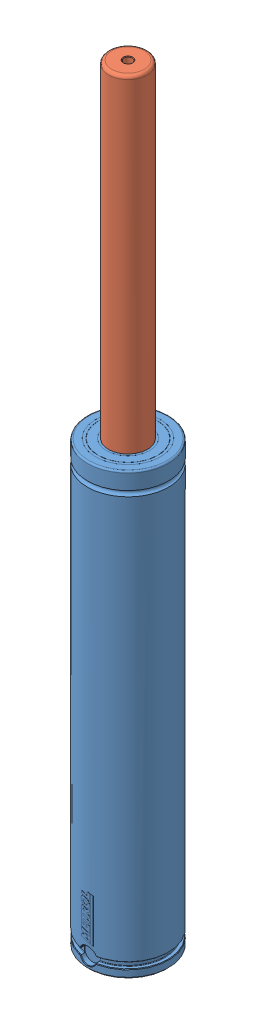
SolidWorks assembly ISNG1500-300.SLDASM, configuration Default (file format 7000). Lengths in mm.
Overall size (75 710 75.11).
2 component instances, 2 part files, 5 mates.
Components (placement in the parent):
- ISNG-1500 Body-1: ISNG-1500 Body.SLDPRT [ISNG-1500-300] x (0 0 1) z (0 -1 0) size (75.11 75 407)
- ISNG-1500 Piston-1: ISNG-1500 Piston.SLDPRT [ISNG-1500-300] at (0 382 0) x (-0.176379 0 0.984322) z (0 -1 0) size (50 50 328)
Mates (geometry in assembly coordinates):
- Concentric1: concentric aligned: cylinder of ISNG-1500 Body-1 through (0 0 0) axis (0 -1 0) radius 18; cylinder of ISNG-1500 Piston-1 through (0 382 0) axis (0 -1 0) radius 18
- LimitDistance1: limit distance anti-aligned: plane of ISNG-1500 Body-1 through (-18 387 0) normal (0 -1 0); plane of ISNG-1500 Piston-1 through (-24.6081 387 -4.4095) normal (0 1 0)
- Coincident12: coincident anti-aligned: plane of ISNG-1500 Body-1; plane of assembly through (0 0 0) normal (1 0 0)
- Coincident13: coincident anti-aligned: plane of ISNG-1500 Body-1 through (0 0 0) normal (0 -1 0); plane of assembly through (0 0 0) normal (0 1 0)
- Coincident14: coincident aligned: plane of ISNG-1500 Body-1; plane of assembly through (0 0 0) normal (0 0 1)
